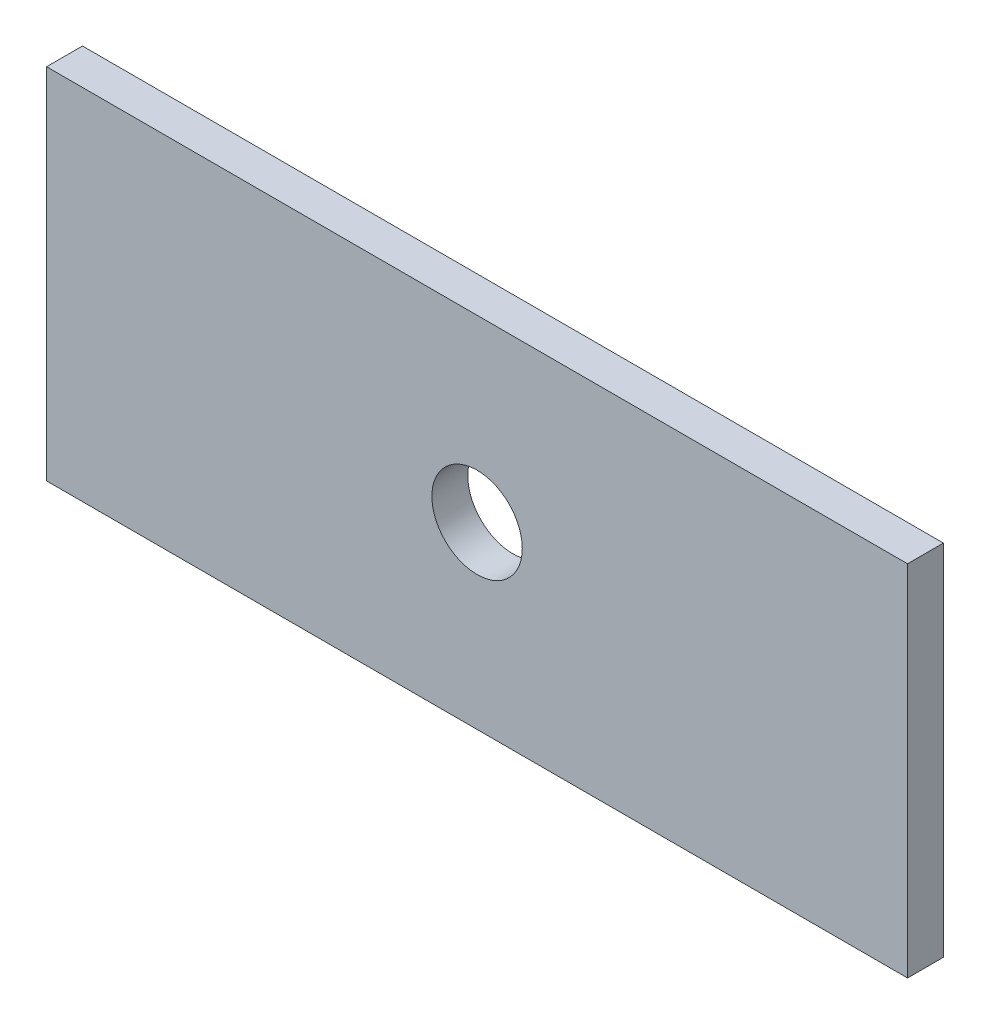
ISO-10303-21;
HEADER;
FILE_DESCRIPTION(('STEP AP214'),'2;1');
FILE_NAME('part.step','',(''),(''),'','','');
FILE_SCHEMA(('AUTOMOTIVE_DESIGN { 1 0 10303 214 1 1 1 1 }'));
ENDSEC;
DATA;
#1=APPLICATION_CONTEXT('core data for automotive mechanical design processes');
#2=APPLICATION_PROTOCOL_DEFINITION('international standard','automotive_design',2000,#1);
#3=PRODUCT_CONTEXT('',#1,'mechanical');
#4=PRODUCT('Part','Part','',(#3));
#5=PRODUCT_RELATED_PRODUCT_CATEGORY('part','',(#4));
#6=PRODUCT_DEFINITION_FORMATION('','',#4);
#7=PRODUCT_DEFINITION_CONTEXT('part definition',#1,'design');
#8=PRODUCT_DEFINITION('design','',#6,#7);
#9=PRODUCT_DEFINITION_SHAPE('','',#8);
#10=(LENGTH_UNIT() NAMED_UNIT(*) SI_UNIT(.MILLI.,.METRE.));
#11=(NAMED_UNIT(*) PLANE_ANGLE_UNIT() SI_UNIT($,.RADIAN.));
#12=(NAMED_UNIT(*) SI_UNIT($,.STERADIAN.) SOLID_ANGLE_UNIT());
#13=UNCERTAINTY_MEASURE_WITH_UNIT(LENGTH_MEASURE(1.E-05),#10,'distance_accuracy_value','');
#14=(GEOMETRIC_REPRESENTATION_CONTEXT(3) GLOBAL_UNCERTAINTY_ASSIGNED_CONTEXT((#13)) GLOBAL_UNIT_ASSIGNED_CONTEXT((#10,
#11,#12)) REPRESENTATION_CONTEXT('',''));
#15=CARTESIAN_POINT('',(0.,0.,0.));
#16=DIRECTION('',(0.,0.,1.));
#17=DIRECTION('',(1.,0.,0.));
#18=AXIS2_PLACEMENT_3D('',#15,#16,#17);
#19=CARTESIAN_POINT('',(0.,0.,3.175));
#20=DIRECTION('',(1.,0.,0.));
#21=DIRECTION('',(0.,1.,0.));
#22=AXIS2_PLACEMENT_3D('',#19,#20,#21);
#23=PLANE('',#22);
#24=DIRECTION('',(0.,-1.,0.));
#25=VECTOR('',#24,1.);
#26=CARTESIAN_POINT('',(0.,0.,0.));
#27=LINE('',#26,#25);
#28=CARTESIAN_POINT('',(0.,31.75,0.));
#29=VERTEX_POINT('',#28);
#30=CARTESIAN_POINT('',(0.,0.,0.));
#31=VERTEX_POINT('',#30);
#32=EDGE_CURVE('E113',#29,#31,#27,.T.);
#33=ORIENTED_EDGE('',*,*,#32,.T.);
#34=DIRECTION('',(0.,0.,-1.));
#35=VECTOR('',#34,1.);
#36=CARTESIAN_POINT('',(0.,0.,3.175));
#37=LINE('',#36,#35);
#38=CARTESIAN_POINT('',(0.,0.,3.175));
#39=VERTEX_POINT('',#38);
#40=EDGE_CURVE('E11',#39,#31,#37,.T.);
#41=ORIENTED_EDGE('',*,*,#40,.F.);
#42=DIRECTION('',(0.,-1.,0.));
#43=VECTOR('',#42,1.);
#44=CARTESIAN_POINT('',(0.,0.,3.175));
#45=LINE('',#44,#43);
#46=CARTESIAN_POINT('',(0.,31.75,3.175));
#47=VERTEX_POINT('',#46);
#48=EDGE_CURVE('E97',#47,#39,#45,.T.);
#49=ORIENTED_EDGE('',*,*,#48,.F.);
#50=DIRECTION('',(0.,0.,-1.));
#51=VECTOR('',#50,1.);
#52=CARTESIAN_POINT('',(0.,31.75,3.175));
#53=LINE('',#52,#51);
#54=EDGE_CURVE('E109',#47,#29,#53,.T.);
#55=ORIENTED_EDGE('',*,*,#54,.T.);
#56=EDGE_LOOP('',(#33,#41,#49,#55));
#57=FACE_BOUND('',#56,.T.);
#58=ADVANCED_FACE('F45',(#57),#23,.F.);
#59=CARTESIAN_POINT('',(0.,0.,3.175));
#60=DIRECTION('',(0.,1.,0.));
#61=DIRECTION('',(0.,0.,1.));
#62=AXIS2_PLACEMENT_3D('',#59,#60,#61);
#63=PLANE('',#62);
#64=DIRECTION('',(1.,0.,0.));
#65=VECTOR('',#64,1.);
#66=CARTESIAN_POINT('',(0.,0.,0.));
#67=LINE('',#66,#65);
#68=CARTESIAN_POINT('',(76.2,0.,0.));
#69=VERTEX_POINT('',#68);
#70=EDGE_CURVE('E102',#31,#69,#67,.T.);
#71=ORIENTED_EDGE('',*,*,#70,.T.);
#72=DIRECTION('',(0.,0.,-1.));
#73=VECTOR('',#72,1.);
#74=CARTESIAN_POINT('',(76.2,0.,3.175));
#75=LINE('',#74,#73);
#76=CARTESIAN_POINT('',(76.2,0.,3.175));
#77=VERTEX_POINT('',#76);
#78=EDGE_CURVE('E54',#77,#69,#75,.T.);
#79=ORIENTED_EDGE('',*,*,#78,.F.);
#80=DIRECTION('',(1.,0.,0.));
#81=VECTOR('',#80,1.);
#82=CARTESIAN_POINT('',(0.,0.,3.175));
#83=LINE('',#82,#81);
#84=EDGE_CURVE('E92',#39,#77,#83,.T.);
#85=ORIENTED_EDGE('',*,*,#84,.F.);
#86=ORIENTED_EDGE('',*,*,#40,.T.);
#87=EDGE_LOOP('',(#71,#79,#85,#86));
#88=FACE_BOUND('',#87,.T.);
#89=ADVANCED_FACE('F101',(#88),#63,.F.);
#90=CARTESIAN_POINT('',(76.2,0.,3.175));
#91=DIRECTION('',(-1.,0.,0.));
#92=DIRECTION('',(0.,-1.,0.));
#93=AXIS2_PLACEMENT_3D('',#90,#91,#92);
#94=PLANE('',#93);
#95=DIRECTION('',(0.,1.,0.));
#96=VECTOR('',#95,1.);
#97=CARTESIAN_POINT('',(76.2,0.,0.));
#98=LINE('',#97,#96);
#99=CARTESIAN_POINT('',(76.2,31.75,0.));
#100=VERTEX_POINT('',#99);
#101=EDGE_CURVE('E79',#69,#100,#98,.T.);
#102=ORIENTED_EDGE('',*,*,#101,.T.);
#103=DIRECTION('',(0.,0.,-1.));
#104=VECTOR('',#103,1.);
#105=CARTESIAN_POINT('',(76.2,31.75,3.175));
#106=LINE('',#105,#104);
#107=CARTESIAN_POINT('',(76.2,31.75,3.175));
#108=VERTEX_POINT('',#107);
#109=EDGE_CURVE('E104',#108,#100,#106,.T.);
#110=ORIENTED_EDGE('',*,*,#109,.F.);
#111=DIRECTION('',(0.,1.,0.));
#112=VECTOR('',#111,1.);
#113=CARTESIAN_POINT('',(76.2,0.,3.175));
#114=LINE('',#113,#112);
#115=EDGE_CURVE('E95',#77,#108,#114,.T.);
#116=ORIENTED_EDGE('',*,*,#115,.F.);
#117=ORIENTED_EDGE('',*,*,#78,.T.);
#118=EDGE_LOOP('',(#102,#110,#116,#117));
#119=FACE_BOUND('',#118,.T.);
#120=ADVANCED_FACE('F105',(#119),#94,.F.);
#121=CARTESIAN_POINT('',(0.,31.75,3.175));
#122=DIRECTION('',(0.,-1.,0.));
#123=DIRECTION('',(0.,0.,-1.));
#124=AXIS2_PLACEMENT_3D('',#121,#122,#123);
#125=PLANE('',#124);
#126=DIRECTION('',(-1.,0.,0.));
#127=VECTOR('',#126,1.);
#128=CARTESIAN_POINT('',(0.,31.75,0.));
#129=LINE('',#128,#127);
#130=EDGE_CURVE('E85',#100,#29,#129,.T.);
#131=ORIENTED_EDGE('',*,*,#130,.T.);
#132=ORIENTED_EDGE('',*,*,#54,.F.);
#133=DIRECTION('',(-1.,0.,0.));
#134=VECTOR('',#133,1.);
#135=CARTESIAN_POINT('',(0.,31.75,3.175));
#136=LINE('',#135,#134);
#137=EDGE_CURVE('E62',#108,#47,#136,.T.);
#138=ORIENTED_EDGE('',*,*,#137,.F.);
#139=ORIENTED_EDGE('',*,*,#109,.T.);
#140=EDGE_LOOP('',(#131,#132,#138,#139));
#141=FACE_BOUND('',#140,.T.);
#142=ADVANCED_FACE('F127',(#141),#125,.F.);
#143=CARTESIAN_POINT('',(0.,0.,3.175));
#144=DIRECTION('',(0.,0.,-1.));
#145=DIRECTION('',(-1.,0.,0.));
#146=AXIS2_PLACEMENT_3D('',#143,#144,#145);
#147=PLANE('',#146);
#148=CARTESIAN_POINT('',(38.1,15.875,3.175));
#149=DIRECTION('',(0.,0.,1.));
#150=DIRECTION('',(1.,0.,0.));
#151=AXIS2_PLACEMENT_3D('',#148,#149,#150);
#152=CIRCLE('',#151,4.0005);
#153=CARTESIAN_POINT('',(42.1005,15.875,3.175));
#154=VERTEX_POINT('',#153);
#155=EDGE_CURVE('E134',#154,#154,#152,.T.);
#156=ORIENTED_EDGE('',*,*,#155,.F.);
#157=EDGE_LOOP('',(#156));
#158=FACE_BOUND('',#157,.T.);
#159=ORIENTED_EDGE('',*,*,#48,.T.);
#160=ORIENTED_EDGE('',*,*,#84,.T.);
#161=ORIENTED_EDGE('',*,*,#115,.T.);
#162=ORIENTED_EDGE('',*,*,#137,.T.);
#163=EDGE_LOOP('',(#159,#160,#161,#162));
#164=FACE_BOUND('',#163,.T.);
#165=ADVANCED_FACE('F93',(#158,#164),#147,.F.);
#166=CARTESIAN_POINT('',(0.,0.,0.));
#167=DIRECTION('',(0.,0.,-1.));
#168=DIRECTION('',(-1.,0.,0.));
#169=AXIS2_PLACEMENT_3D('',#166,#167,#168);
#170=PLANE('',#169);
#171=CARTESIAN_POINT('',(38.1,15.875,0.));
#172=DIRECTION('',(0.,0.,1.));
#173=DIRECTION('',(1.,0.,0.));
#174=AXIS2_PLACEMENT_3D('',#171,#172,#173);
#175=CIRCLE('',#174,4.0005);
#176=CARTESIAN_POINT('',(42.1005,15.875,0.));
#177=VERTEX_POINT('',#176);
#178=EDGE_CURVE('E117',#177,#177,#175,.T.);
#179=ORIENTED_EDGE('',*,*,#178,.T.);
#180=EDGE_LOOP('',(#179));
#181=FACE_BOUND('',#180,.T.);
#182=ORIENTED_EDGE('',*,*,#32,.F.);
#183=ORIENTED_EDGE('',*,*,#130,.F.);
#184=ORIENTED_EDGE('',*,*,#101,.F.);
#185=ORIENTED_EDGE('',*,*,#70,.F.);
#186=EDGE_LOOP('',(#182,#183,#184,#185));
#187=FACE_BOUND('',#186,.T.);
#188=ADVANCED_FACE('F130',(#181,#187),#170,.T.);
#189=CARTESIAN_POINT('',(38.1,15.875,0.));
#190=DIRECTION('',(0.,0.,1.));
#191=DIRECTION('',(1.,0.,0.));
#192=AXIS2_PLACEMENT_3D('',#189,#190,#191);
#193=CYLINDRICAL_SURFACE('',#192,4.0005);
#194=ORIENTED_EDGE('',*,*,#178,.F.);
#195=EDGE_LOOP('',(#194));
#196=FACE_BOUND('',#195,.T.);
#197=ORIENTED_EDGE('',*,*,#155,.T.);
#198=EDGE_LOOP('',(#197));
#199=FACE_BOUND('',#198,.T.);
#200=ADVANCED_FACE('F143',(#196,#199),#193,.F.);
#201=CLOSED_SHELL('',(#58,#89,#120,#142,#165,#188,#200));
#202=MANIFOLD_SOLID_BREP('B2',#201);
#203=ADVANCED_BREP_SHAPE_REPRESENTATION('',(#18,#202),#14);
#204=SHAPE_DEFINITION_REPRESENTATION(#9,#203);
ENDSEC;
END-ISO-10303-21;
